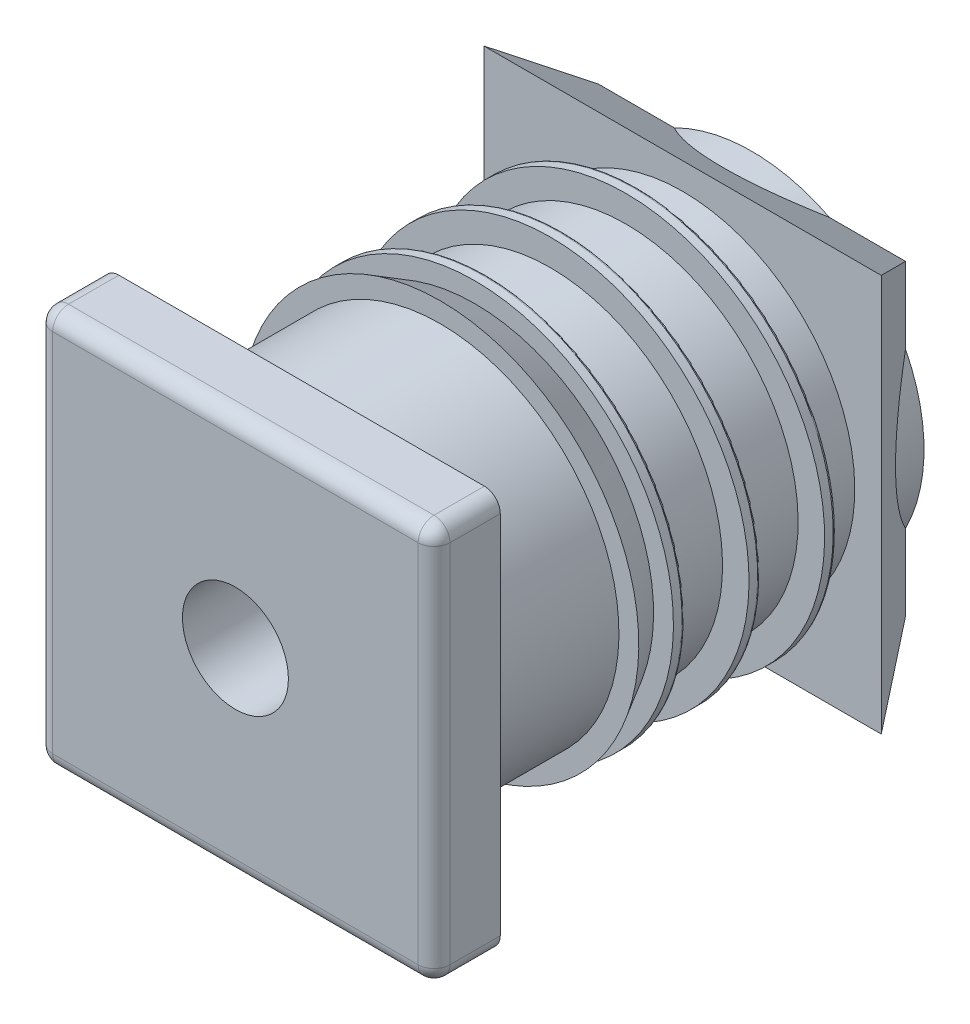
ISO-10303-21;
HEADER;
FILE_DESCRIPTION(('STEP AP214'),'2;1');
FILE_NAME('part.step','',(''),(''),'','','');
FILE_SCHEMA(('AUTOMOTIVE_DESIGN { 1 0 10303 214 1 1 1 1 }'));
ENDSEC;
DATA;
#1=APPLICATION_CONTEXT('core data for automotive mechanical design processes');
#2=APPLICATION_PROTOCOL_DEFINITION('international standard','automotive_design',2000,#1);
#3=PRODUCT_CONTEXT('',#1,'mechanical');
#4=PRODUCT('Part','Part','',(#3));
#5=PRODUCT_RELATED_PRODUCT_CATEGORY('part','',(#4));
#6=PRODUCT_DEFINITION_FORMATION('','',#4);
#7=PRODUCT_DEFINITION_CONTEXT('part definition',#1,'design');
#8=PRODUCT_DEFINITION('design','',#6,#7);
#9=PRODUCT_DEFINITION_SHAPE('','',#8);
#10=(LENGTH_UNIT() NAMED_UNIT(*) SI_UNIT(.MILLI.,.METRE.));
#11=(NAMED_UNIT(*) PLANE_ANGLE_UNIT() SI_UNIT($,.RADIAN.));
#12=(NAMED_UNIT(*) SI_UNIT($,.STERADIAN.) SOLID_ANGLE_UNIT());
#13=UNCERTAINTY_MEASURE_WITH_UNIT(LENGTH_MEASURE(1.E-05),#10,'distance_accuracy_value','');
#14=(GEOMETRIC_REPRESENTATION_CONTEXT(3) GLOBAL_UNCERTAINTY_ASSIGNED_CONTEXT((#13)) GLOBAL_UNIT_ASSIGNED_CONTEXT((#10,
#11,#12)) REPRESENTATION_CONTEXT('',''));
#15=CARTESIAN_POINT('',(0.,0.,0.));
#16=DIRECTION('',(0.,0.,1.));
#17=DIRECTION('',(1.,0.,0.));
#18=AXIS2_PLACEMENT_3D('',#15,#16,#17);
#19=CARTESIAN_POINT('',(-13.9,0.,-19.6340659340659));
#20=DIRECTION('',(0.,0.,-1.));
#21=DIRECTION('',(0.,-1.,0.));
#22=AXIS2_PLACEMENT_3D('',#19,#20,#21);
#23=PLANE('',#22);
#24=CARTESIAN_POINT('',(0.,0.,-19.6340659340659));
#25=DIRECTION('',(0.,0.,1.));
#26=DIRECTION('',(0.,-1.,0.));
#27=AXIS2_PLACEMENT_3D('',#24,#25,#26);
#28=CIRCLE('',#27,14.8);
#29=CARTESIAN_POINT('',(0.,-14.8,-19.6340659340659));
#30=VERTEX_POINT('',#29);
#31=CARTESIAN_POINT('',(0.,14.8,-19.6340659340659));
#32=VERTEX_POINT('',#31);
#33=EDGE_CURVE('E178',#30,#32,#28,.T.);
#34=ORIENTED_EDGE('',*,*,#33,.F.);
#35=CARTESIAN_POINT('',(0.,0.,-19.6340659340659));
#36=DIRECTION('',(0.,0.,1.));
#37=DIRECTION('',(-1.,0.,0.));
#38=AXIS2_PLACEMENT_3D('',#35,#36,#37);
#39=CIRCLE('',#38,14.8);
#40=CARTESIAN_POINT('',(-14.8,0.,-19.6340659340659));
#41=VERTEX_POINT('',#40);
#42=EDGE_CURVE('E171',#41,#30,#39,.T.);
#43=ORIENTED_EDGE('',*,*,#42,.F.);
#44=CARTESIAN_POINT('',(0.,0.,-19.6340659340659));
#45=DIRECTION('',(0.,0.,1.));
#46=DIRECTION('',(0.,1.,0.));
#47=AXIS2_PLACEMENT_3D('',#44,#45,#46);
#48=CIRCLE('',#47,14.8);
#49=EDGE_CURVE('E175',#32,#41,#48,.T.);
#50=ORIENTED_EDGE('',*,*,#49,.F.);
#51=EDGE_LOOP('',(#34,#43,#50));
#52=FACE_BOUND('',#51,.T.);
#53=CARTESIAN_POINT('',(0.,0.,-19.6340659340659));
#54=DIRECTION('',(0.,0.,1.));
#55=DIRECTION('',(0.,1.,0.));
#56=AXIS2_PLACEMENT_3D('',#53,#54,#55);
#57=CIRCLE('',#56,13.);
#58=CARTESIAN_POINT('',(0.,13.,-19.6340659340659));
#59=VERTEX_POINT('',#58);
#60=EDGE_CURVE('E188',#59,#59,#57,.F.);
#61=ORIENTED_EDGE('',*,*,#60,.F.);
#62=EDGE_LOOP('',(#61));
#63=FACE_BOUND('',#62,.T.);
#64=ADVANCED_FACE('F14',(#52,#63),#23,.T.);
#65=CARTESIAN_POINT('',(0.,0.,-22.0626373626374));
#66=DIRECTION('',(0.,0.,1.));
#67=DIRECTION('',(0.,1.,0.));
#68=AXIS2_PLACEMENT_3D('',#65,#66,#67);
#69=CYLINDRICAL_SURFACE('',#68,13.);
#70=CARTESIAN_POINT('',(0.,0.,-24.4912087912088));
#71=DIRECTION('',(0.,0.,1.));
#72=DIRECTION('',(0.,1.,0.));
#73=AXIS2_PLACEMENT_3D('',#70,#71,#72);
#74=CIRCLE('',#73,13.);
#75=CARTESIAN_POINT('',(0.,13.,-24.4912087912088));
#76=VERTEX_POINT('',#75);
#77=EDGE_CURVE('E339',#76,#76,#74,.F.);
#78=ORIENTED_EDGE('',*,*,#77,.F.);
#79=EDGE_LOOP('',(#78));
#80=FACE_BOUND('',#79,.T.);
#81=ORIENTED_EDGE('',*,*,#60,.T.);
#82=EDGE_LOOP('',(#81));
#83=FACE_BOUND('',#82,.T.);
#84=ADVANCED_FACE('F210',(#80,#83),#69,.T.);
#85=CARTESIAN_POINT('',(0.,0.,-19.4340659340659));
#86=DIRECTION('',(0.,0.,-1.));
#87=DIRECTION('',(0.,-1.,0.));
#88=AXIS2_PLACEMENT_3D('',#85,#86,#87);
#89=TOROIDAL_SURFACE('',#88,14.8,0.2);
#90=ORIENTED_EDGE('',*,*,#42,.T.);
#91=ORIENTED_EDGE('',*,*,#33,.T.);
#92=ORIENTED_EDGE('',*,*,#49,.T.);
#93=EDGE_LOOP('',(#90,#91,#92));
#94=FACE_BOUND('',#93,.T.);
#95=CARTESIAN_POINT('',(0.,0.,-19.4340659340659));
#96=DIRECTION('',(0.,0.,1.));
#97=DIRECTION('',(0.,1.,0.));
#98=AXIS2_PLACEMENT_3D('',#95,#96,#97);
#99=CIRCLE('',#98,15.);
#100=CARTESIAN_POINT('',(0.,15.,-19.4340659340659));
#101=VERTEX_POINT('',#100);
#102=EDGE_CURVE('E218',#101,#101,#99,.T.);
#103=ORIENTED_EDGE('',*,*,#102,.F.);
#104=EDGE_LOOP('',(#103));
#105=FACE_BOUND('',#104,.T.);
#106=ADVANCED_FACE('F185',(#94,#105),#89,.T.);
#107=CARTESIAN_POINT('',(-14.,0.,-24.4912087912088));
#108=DIRECTION('',(0.,0.,1.));
#109=DIRECTION('',(0.,1.,0.));
#110=AXIS2_PLACEMENT_3D('',#107,#108,#109);
#111=PLANE('',#110);
#112=ORIENTED_EDGE('',*,*,#77,.T.);
#113=EDGE_LOOP('',(#112));
#114=FACE_BOUND('',#113,.T.);
#115=CARTESIAN_POINT('',(0.,0.,-24.4912087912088));
#116=DIRECTION('',(0.,0.,1.));
#117=DIRECTION('',(0.,1.,0.));
#118=AXIS2_PLACEMENT_3D('',#115,#116,#117);
#119=CIRCLE('',#118,15.);
#120=CARTESIAN_POINT('',(0.,15.,-24.4912087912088));
#121=VERTEX_POINT('',#120);
#122=EDGE_CURVE('E336',#121,#121,#119,.F.);
#123=ORIENTED_EDGE('',*,*,#122,.F.);
#124=EDGE_LOOP('',(#123));
#125=FACE_BOUND('',#124,.T.);
#126=ADVANCED_FACE('F209',(#114,#125),#111,.T.);
#127=CARTESIAN_POINT('',(0.,0.,-19.1090659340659));
#128=DIRECTION('',(0.,0.,1.));
#129=DIRECTION('',(0.,1.,0.));
#130=AXIS2_PLACEMENT_3D('',#127,#128,#129);
#131=CYLINDRICAL_SURFACE('',#130,15.);
#132=ORIENTED_EDGE('',*,*,#102,.T.);
#133=EDGE_LOOP('',(#132));
#134=FACE_BOUND('',#133,.T.);
#135=CARTESIAN_POINT('',(0.,0.,-18.7840659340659));
#136=DIRECTION('',(0.,0.,1.));
#137=DIRECTION('',(0.,1.,0.));
#138=AXIS2_PLACEMENT_3D('',#135,#136,#137);
#139=CIRCLE('',#138,15.);
#140=CARTESIAN_POINT('',(0.,15.,-18.7840659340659));
#141=VERTEX_POINT('',#140);
#142=EDGE_CURVE('E333',#141,#141,#139,.T.);
#143=ORIENTED_EDGE('',*,*,#142,.F.);
#144=EDGE_LOOP('',(#143));
#145=FACE_BOUND('',#144,.T.);
#146=ADVANCED_FACE('F482',(#134,#145),#131,.T.);
#147=CARTESIAN_POINT('',(0.,0.,-24.8162087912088));
#148=DIRECTION('',(0.,0.,1.));
#149=DIRECTION('',(0.,1.,0.));
#150=AXIS2_PLACEMENT_3D('',#147,#148,#149);
#151=CYLINDRICAL_SURFACE('',#150,15.);
#152=ORIENTED_EDGE('',*,*,#122,.T.);
#153=EDGE_LOOP('',(#152));
#154=FACE_BOUND('',#153,.T.);
#155=CARTESIAN_POINT('',(0.,0.,-25.1412087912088));
#156=DIRECTION('',(0.,0.,-1.));
#157=DIRECTION('',(0.,-1.,0.));
#158=AXIS2_PLACEMENT_3D('',#155,#156,#157);
#159=CIRCLE('',#158,15.);
#160=CARTESIAN_POINT('',(0.,-15.,-25.1412087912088));
#161=VERTEX_POINT('',#160);
#162=EDGE_CURVE('E332',#161,#161,#159,.T.);
#163=ORIENTED_EDGE('',*,*,#162,.F.);
#164=EDGE_LOOP('',(#163));
#165=FACE_BOUND('',#164,.T.);
#166=ADVANCED_FACE('F480',(#154,#165),#151,.T.);
#167=CARTESIAN_POINT('',(-14.,0.,-18.7840659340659));
#168=DIRECTION('',(0.,0.,1.));
#169=DIRECTION('',(0.,1.,0.));
#170=AXIS2_PLACEMENT_3D('',#167,#168,#169);
#171=PLANE('',#170);
#172=CARTESIAN_POINT('',(0.,0.,-18.7840659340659));
#173=DIRECTION('',(0.,0.,1.));
#174=DIRECTION('',(0.,1.,0.));
#175=AXIS2_PLACEMENT_3D('',#172,#173,#174);
#176=CIRCLE('',#175,13.);
#177=CARTESIAN_POINT('',(0.,13.,-18.7840659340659));
#178=VERTEX_POINT('',#177);
#179=EDGE_CURVE('E328',#178,#178,#176,.T.);
#180=ORIENTED_EDGE('',*,*,#179,.F.);
#181=EDGE_LOOP('',(#180));
#182=FACE_BOUND('',#181,.T.);
#183=ORIENTED_EDGE('',*,*,#142,.T.);
#184=EDGE_LOOP('',(#183));
#185=FACE_BOUND('',#184,.T.);
#186=ADVANCED_FACE('F460',(#182,#185),#171,.T.);
#187=CARTESIAN_POINT('',(0.,0.,-25.1412087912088));
#188=DIRECTION('',(0.,0.,-1.));
#189=DIRECTION('',(0.,-1.,0.));
#190=AXIS2_PLACEMENT_3D('',#187,#188,#189);
#191=TOROIDAL_SURFACE('',#190,14.8,0.2);
#192=ORIENTED_EDGE('',*,*,#162,.T.);
#193=EDGE_LOOP('',(#192));
#194=FACE_BOUND('',#193,.T.);
#195=CARTESIAN_POINT('',(0.,0.,-25.3412087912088));
#196=DIRECTION('',(0.,0.,1.));
#197=DIRECTION('',(0.,1.,0.));
#198=AXIS2_PLACEMENT_3D('',#195,#196,#197);
#199=CIRCLE('',#198,14.8);
#200=CARTESIAN_POINT('',(-14.8,0.,-25.3412087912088));
#201=VERTEX_POINT('',#200);
#202=CARTESIAN_POINT('',(0.,14.8,-25.3412087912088));
#203=VERTEX_POINT('',#202);
#204=EDGE_CURVE('E331',#201,#203,#199,.F.);
#205=ORIENTED_EDGE('',*,*,#204,.F.);
#206=CARTESIAN_POINT('',(0.,0.,-25.3412087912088));
#207=DIRECTION('',(0.,0.,1.));
#208=DIRECTION('',(-1.,0.,0.));
#209=AXIS2_PLACEMENT_3D('',#206,#207,#208);
#210=CIRCLE('',#209,14.8);
#211=CARTESIAN_POINT('',(0.,-14.8,-25.3412087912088));
#212=VERTEX_POINT('',#211);
#213=EDGE_CURVE('E327',#212,#201,#210,.F.);
#214=ORIENTED_EDGE('',*,*,#213,.F.);
#215=CARTESIAN_POINT('',(0.,0.,-25.3412087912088));
#216=DIRECTION('',(0.,0.,1.));
#217=DIRECTION('',(0.,-1.,0.));
#218=AXIS2_PLACEMENT_3D('',#215,#216,#217);
#219=CIRCLE('',#218,14.8);
#220=EDGE_CURVE('E434',#203,#212,#219,.F.);
#221=ORIENTED_EDGE('',*,*,#220,.F.);
#222=EDGE_LOOP('',(#205,#214,#221));
#223=FACE_BOUND('',#222,.T.);
#224=ADVANCED_FACE('F455',(#194,#223),#191,.T.);
#225=CARTESIAN_POINT('',(0.,0.,-16.3554945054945));
#226=DIRECTION('',(0.,0.,1.));
#227=DIRECTION('',(0.,1.,0.));
#228=AXIS2_PLACEMENT_3D('',#225,#226,#227);
#229=CYLINDRICAL_SURFACE('',#228,13.);
#230=ORIENTED_EDGE('',*,*,#179,.T.);
#231=EDGE_LOOP('',(#230));
#232=FACE_BOUND('',#231,.T.);
#233=CARTESIAN_POINT('',(0.,0.,-13.9269230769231));
#234=DIRECTION('',(0.,0.,1.));
#235=DIRECTION('',(0.,1.,0.));
#236=AXIS2_PLACEMENT_3D('',#233,#234,#235);
#237=CIRCLE('',#236,13.);
#238=CARTESIAN_POINT('',(0.,13.,-13.9269230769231));
#239=VERTEX_POINT('',#238);
#240=EDGE_CURVE('E324',#239,#239,#237,.T.);
#241=ORIENTED_EDGE('',*,*,#240,.F.);
#242=EDGE_LOOP('',(#241));
#243=FACE_BOUND('',#242,.T.);
#244=ADVANCED_FACE('F459',(#232,#243),#229,.T.);
#245=CARTESIAN_POINT('',(-13.9,0.,-25.3412087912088));
#246=DIRECTION('',(0.,0.,-1.));
#247=DIRECTION('',(0.,-1.,0.));
#248=AXIS2_PLACEMENT_3D('',#245,#246,#247);
#249=PLANE('',#248);
#250=ORIENTED_EDGE('',*,*,#220,.T.);
#251=ORIENTED_EDGE('',*,*,#213,.T.);
#252=ORIENTED_EDGE('',*,*,#204,.T.);
#253=EDGE_LOOP('',(#250,#251,#252));
#254=FACE_BOUND('',#253,.T.);
#255=CARTESIAN_POINT('',(0.,0.,-25.3412087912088));
#256=DIRECTION('',(0.,0.,1.));
#257=DIRECTION('',(0.,1.,0.));
#258=AXIS2_PLACEMENT_3D('',#255,#256,#257);
#259=CIRCLE('',#258,13.);
#260=CARTESIAN_POINT('',(0.,13.,-25.3412087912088));
#261=VERTEX_POINT('',#260);
#262=EDGE_CURVE('E320',#261,#261,#259,.F.);
#263=ORIENTED_EDGE('',*,*,#262,.F.);
#264=EDGE_LOOP('',(#263));
#265=FACE_BOUND('',#264,.T.);
#266=ADVANCED_FACE('F392',(#254,#265),#249,.T.);
#267=CARTESIAN_POINT('',(-13.9,0.,-13.9269230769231));
#268=DIRECTION('',(0.,0.,-1.));
#269=DIRECTION('',(0.,-1.,0.));
#270=AXIS2_PLACEMENT_3D('',#267,#268,#269);
#271=PLANE('',#270);
#272=CARTESIAN_POINT('',(0.,0.,-13.9269230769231));
#273=DIRECTION('',(0.,0.,1.));
#274=DIRECTION('',(0.,-1.,0.));
#275=AXIS2_PLACEMENT_3D('',#272,#273,#274);
#276=CIRCLE('',#275,14.8);
#277=CARTESIAN_POINT('',(0.,-14.8,-13.9269230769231));
#278=VERTEX_POINT('',#277);
#279=CARTESIAN_POINT('',(0.,14.8,-13.9269230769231));
#280=VERTEX_POINT('',#279);
#281=EDGE_CURVE('E319',#278,#280,#276,.T.);
#282=ORIENTED_EDGE('',*,*,#281,.F.);
#283=CARTESIAN_POINT('',(0.,0.,-13.9269230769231));
#284=DIRECTION('',(0.,0.,1.));
#285=DIRECTION('',(-1.,0.,0.));
#286=AXIS2_PLACEMENT_3D('',#283,#284,#285);
#287=CIRCLE('',#286,14.8);
#288=CARTESIAN_POINT('',(-14.8,0.,-13.9269230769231));
#289=VERTEX_POINT('',#288);
#290=EDGE_CURVE('E409',#289,#278,#287,.T.);
#291=ORIENTED_EDGE('',*,*,#290,.F.);
#292=CARTESIAN_POINT('',(0.,0.,-13.9269230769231));
#293=DIRECTION('',(0.,0.,1.));
#294=DIRECTION('',(0.,1.,0.));
#295=AXIS2_PLACEMENT_3D('',#292,#293,#294);
#296=CIRCLE('',#295,14.8);
#297=EDGE_CURVE('E323',#280,#289,#296,.T.);
#298=ORIENTED_EDGE('',*,*,#297,.F.);
#299=EDGE_LOOP('',(#282,#291,#298));
#300=FACE_BOUND('',#299,.T.);
#301=ORIENTED_EDGE('',*,*,#240,.T.);
#302=EDGE_LOOP('',(#301));
#303=FACE_BOUND('',#302,.T.);
#304=ADVANCED_FACE('F383',(#300,#303),#271,.T.);
#305=CARTESIAN_POINT('',(0.,0.,-29.6706043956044));
#306=DIRECTION('',(0.,0.,1.));
#307=DIRECTION('',(0.,1.,0.));
#308=AXIS2_PLACEMENT_3D('',#305,#306,#307);
#309=CYLINDRICAL_SURFACE('',#308,13.);
#310=ORIENTED_EDGE('',*,*,#262,.T.);
#311=EDGE_LOOP('',(#310));
#312=FACE_BOUND('',#311,.T.);
#313=CARTESIAN_POINT('',(0.,0.,-28.7692307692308));
#314=DIRECTION('',(0.,0.,1.));
#315=DIRECTION('',(0.,1.,0.));
#316=AXIS2_PLACEMENT_3D('',#313,#314,#315);
#317=CIRCLE('',#316,13.);
#318=CARTESIAN_POINT('',(0.,13.,-28.7692307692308));
#319=VERTEX_POINT('',#318);
#320=EDGE_CURVE('E315',#319,#319,#317,.F.);
#321=ORIENTED_EDGE('',*,*,#320,.F.);
#322=EDGE_LOOP('',(#321));
#323=FACE_BOUND('',#322,.T.);
#324=ADVANCED_FACE('F366',(#312,#323),#309,.T.);
#325=CARTESIAN_POINT('',(0.,0.,-13.7269230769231));
#326=DIRECTION('',(0.,0.,-1.));
#327=DIRECTION('',(0.,-1.,0.));
#328=AXIS2_PLACEMENT_3D('',#325,#326,#327);
#329=TOROIDAL_SURFACE('',#328,14.8,0.2);
#330=ORIENTED_EDGE('',*,*,#290,.T.);
#331=ORIENTED_EDGE('',*,*,#281,.T.);
#332=ORIENTED_EDGE('',*,*,#297,.T.);
#333=EDGE_LOOP('',(#330,#331,#332));
#334=FACE_BOUND('',#333,.T.);
#335=CARTESIAN_POINT('',(0.,0.,-13.7269230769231));
#336=DIRECTION('',(0.,0.,1.));
#337=DIRECTION('',(0.,1.,0.));
#338=AXIS2_PLACEMENT_3D('',#335,#336,#337);
#339=CIRCLE('',#338,15.);
#340=CARTESIAN_POINT('',(0.,15.,-13.7269230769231));
#341=VERTEX_POINT('',#340);
#342=EDGE_CURVE('E318',#341,#341,#339,.T.);
#343=ORIENTED_EDGE('',*,*,#342,.F.);
#344=EDGE_LOOP('',(#343));
#345=FACE_BOUND('',#344,.T.);
#346=ADVANCED_FACE('F354',(#334,#345),#329,.T.);
#347=CARTESIAN_POINT('',(15.,-15.,-28.7692307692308));
#348=DIRECTION('',(0.,0.,1.));
#349=DIRECTION('',(0.,1.,0.));
#350=AXIS2_PLACEMENT_3D('',#347,#348,#349);
#351=PLANE('',#350);
#352=DIRECTION('',(-1.,0.,0.));
#353=VECTOR('',#352,1.);
#354=CARTESIAN_POINT('',(-15.,-15.,-28.7692307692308));
#355=LINE('',#354,#353);
#356=CARTESIAN_POINT('',(-15.,-15.,-28.7692307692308));
#357=VERTEX_POINT('',#356);
#358=CARTESIAN_POINT('',(15.,-15.,-28.7692307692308));
#359=VERTEX_POINT('',#358);
#360=EDGE_CURVE('E314',#357,#359,#355,.F.);
#361=ORIENTED_EDGE('',*,*,#360,.T.);
#362=DIRECTION('',(0.,-1.,0.));
#363=VECTOR('',#362,1.);
#364=CARTESIAN_POINT('',(15.,-15.,-28.7692307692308));
#365=LINE('',#364,#363);
#366=CARTESIAN_POINT('',(15.,15.,-28.7692307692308));
#367=VERTEX_POINT('',#366);
#368=EDGE_CURVE('E621',#367,#359,#365,.T.);
#369=ORIENTED_EDGE('',*,*,#368,.F.);
#370=DIRECTION('',(-1.,0.,0.));
#371=VECTOR('',#370,1.);
#372=CARTESIAN_POINT('',(-15.,15.,-28.7692307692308));
#373=LINE('',#372,#371);
#374=CARTESIAN_POINT('',(-15.,15.,-28.7692307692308));
#375=VERTEX_POINT('',#374);
#376=EDGE_CURVE('E623',#367,#375,#373,.T.);
#377=ORIENTED_EDGE('',*,*,#376,.T.);
#378=DIRECTION('',(0.,-1.,0.));
#379=VECTOR('',#378,1.);
#380=CARTESIAN_POINT('',(-15.,-15.,-28.7692307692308));
#381=LINE('',#380,#379);
#382=EDGE_CURVE('E624',#357,#375,#381,.F.);
#383=ORIENTED_EDGE('',*,*,#382,.F.);
#384=EDGE_LOOP('',(#361,#369,#377,#383));
#385=FACE_BOUND('',#384,.T.);
#386=ORIENTED_EDGE('',*,*,#320,.T.);
#387=EDGE_LOOP('',(#386));
#388=FACE_BOUND('',#387,.T.);
#389=ADVANCED_FACE('F365',(#385,#388),#351,.T.);
#390=CARTESIAN_POINT('',(0.,0.,-13.4019230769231));
#391=DIRECTION('',(0.,0.,1.));
#392=DIRECTION('',(0.,1.,0.));
#393=AXIS2_PLACEMENT_3D('',#390,#391,#392);
#394=CYLINDRICAL_SURFACE('',#393,15.);
#395=ORIENTED_EDGE('',*,*,#342,.T.);
#396=EDGE_LOOP('',(#395));
#397=FACE_BOUND('',#396,.T.);
#398=CARTESIAN_POINT('',(0.,0.,-13.0769230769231));
#399=DIRECTION('',(0.,0.,1.));
#400=DIRECTION('',(0.,1.,0.));
#401=AXIS2_PLACEMENT_3D('',#398,#399,#400);
#402=CIRCLE('',#401,15.);
#403=CARTESIAN_POINT('',(0.,15.,-13.0769230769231));
#404=VERTEX_POINT('',#403);
#405=EDGE_CURVE('E298',#404,#404,#402,.T.);
#406=ORIENTED_EDGE('',*,*,#405,.F.);
#407=EDGE_LOOP('',(#406));
#408=FACE_BOUND('',#407,.T.);
#409=ADVANCED_FACE('F602',(#397,#408),#394,.T.);
#410=CARTESIAN_POINT('',(0.,0.,-29.6706043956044));
#411=DIRECTION('',(0.,0.,1.));
#412=DIRECTION('',(0.,1.,0.));
#413=AXIS2_PLACEMENT_3D('',#410,#411,#412);
#414=CYLINDRICAL_SURFACE('',#413,13.);
#415=CARTESIAN_POINT('',(0.,0.,-51.8672052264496));
#416=DIRECTION('',(0.,0.838670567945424,0.544639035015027));
#417=DIRECTION('',(0.,-0.544639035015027,0.838670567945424));
#418=AXIS2_PLACEMENT_3D('',#415,#416,#417);
#419=ELLIPSE('',#418,23.8690199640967,13.);
#420=CARTESIAN_POINT('',(5.86243119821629,-11.6030987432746,-34.));
#421=VERTEX_POINT('',#420);
#422=CARTESIAN_POINT('',(-5.86243119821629,-11.6030987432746,-34.));
#423=VERTEX_POINT('',#422);
#424=EDGE_CURVE('E120',#421,#423,#419,.F.);
#425=ORIENTED_EDGE('',*,*,#424,.T.);
#426=CARTESIAN_POINT('',(0.,0.,-34.));
#427=DIRECTION('',(0.,0.,1.));
#428=DIRECTION('',(0.,1.,0.));
#429=AXIS2_PLACEMENT_3D('',#426,#427,#428);
#430=CIRCLE('',#429,13.);
#431=EDGE_CURVE('E293',#421,#423,#430,.F.);
#432=ORIENTED_EDGE('',*,*,#431,.F.);
#433=EDGE_LOOP('',(#425,#432));
#434=FACE_BOUND('',#433,.T.);
#435=ADVANCED_FACE('F600',(#434),#414,.T.);
#436=CARTESIAN_POINT('',(-15.,-15.,-28.7692307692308));
#437=DIRECTION('',(0.,0.838670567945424,0.544639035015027));
#438=DIRECTION('',(0.,0.544639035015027,-0.838670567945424));
#439=AXIS2_PLACEMENT_3D('',#436,#437,#438);
#440=PLANE('',#439);
#441=DIRECTION('',(-1.,0.,0.));
#442=VECTOR('',#441,1.);
#443=CARTESIAN_POINT('',(-11.6030987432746,-11.6030987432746,-34.));
#444=LINE('',#443,#442);
#445=CARTESIAN_POINT('',(11.6030987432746,-11.6030987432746,-34.));
#446=VERTEX_POINT('',#445);
#447=EDGE_CURVE('E297',#446,#421,#444,.T.);
#448=ORIENTED_EDGE('',*,*,#447,.F.);
#449=DIRECTION('',(-0.47830007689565,0.478300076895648,-0.736517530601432));
#450=VECTOR('',#449,1.);
#451=CARTESIAN_POINT('',(15.,-15.,-28.7692307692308));
#452=LINE('',#451,#450);
#453=EDGE_CURVE('E127',#359,#446,#452,.T.);
#454=ORIENTED_EDGE('',*,*,#453,.F.);
#455=ORIENTED_EDGE('',*,*,#360,.F.);
#456=DIRECTION('',(-0.47830007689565,-0.478300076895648,0.736517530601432));
#457=VECTOR('',#456,1.);
#458=CARTESIAN_POINT('',(-11.6030987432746,-11.6030987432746,-34.));
#459=LINE('',#458,#457);
#460=CARTESIAN_POINT('',(-11.6030987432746,-11.6030987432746,-34.));
#461=VERTEX_POINT('',#460);
#462=EDGE_CURVE('E312',#461,#357,#459,.T.);
#463=ORIENTED_EDGE('',*,*,#462,.F.);
#464=DIRECTION('',(-1.,0.,0.));
#465=VECTOR('',#464,1.);
#466=CARTESIAN_POINT('',(-11.6030987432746,-11.6030987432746,-34.));
#467=LINE('',#466,#465);
#468=EDGE_CURVE('E296',#423,#461,#467,.T.);
#469=ORIENTED_EDGE('',*,*,#468,.F.);
#470=ORIENTED_EDGE('',*,*,#424,.F.);
#471=EDGE_LOOP('',(#448,#454,#455,#463,#469,#470));
#472=FACE_BOUND('',#471,.T.);
#473=ADVANCED_FACE('F596',(#472),#440,.F.);
#474=CARTESIAN_POINT('',(0.,0.,-29.6706043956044));
#475=DIRECTION('',(0.,0.,1.));
#476=DIRECTION('',(0.,1.,0.));
#477=AXIS2_PLACEMENT_3D('',#474,#475,#476);
#478=CYLINDRICAL_SURFACE('',#477,13.);
#479=CARTESIAN_POINT('',(0.,0.,-51.8672052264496));
#480=DIRECTION('',(-0.838670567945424,0.,-0.544639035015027));
#481=DIRECTION('',(-0.544639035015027,0.,0.838670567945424));
#482=AXIS2_PLACEMENT_3D('',#479,#480,#481);
#483=ELLIPSE('',#482,23.8690199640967,13.);
#484=CARTESIAN_POINT('',(-11.6030987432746,5.8624311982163,-34.));
#485=VERTEX_POINT('',#484);
#486=CARTESIAN_POINT('',(-11.6030987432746,-5.86243119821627,-34.));
#487=VERTEX_POINT('',#486);
#488=EDGE_CURVE('E309',#485,#487,#483,.F.);
#489=ORIENTED_EDGE('',*,*,#488,.F.);
#490=CARTESIAN_POINT('',(0.,0.,-34.));
#491=DIRECTION('',(0.,0.,1.));
#492=DIRECTION('',(0.,1.,0.));
#493=AXIS2_PLACEMENT_3D('',#490,#491,#492);
#494=CIRCLE('',#493,13.);
#495=EDGE_CURVE('E288',#487,#485,#494,.F.);
#496=ORIENTED_EDGE('',*,*,#495,.F.);
#497=EDGE_LOOP('',(#489,#496));
#498=FACE_BOUND('',#497,.T.);
#499=ADVANCED_FACE('F592',(#498),#478,.T.);
#500=CARTESIAN_POINT('',(-15.,-15.,-28.7692307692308));
#501=DIRECTION('',(-0.838670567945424,0.,-0.544639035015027));
#502=DIRECTION('',(0.544639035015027,0.,-0.838670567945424));
#503=AXIS2_PLACEMENT_3D('',#500,#501,#502);
#504=PLANE('',#503);
#505=DIRECTION('',(0.478300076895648,-0.47830007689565,-0.736517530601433));
#506=VECTOR('',#505,1.);
#507=CARTESIAN_POINT('',(-15.,15.,-28.7692307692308));
#508=LINE('',#507,#506);
#509=CARTESIAN_POINT('',(-11.6030987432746,11.6030987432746,-34.));
#510=VERTEX_POINT('',#509);
#511=EDGE_CURVE('E308',#375,#510,#508,.T.);
#512=ORIENTED_EDGE('',*,*,#511,.T.);
#513=DIRECTION('',(0.,-1.,0.));
#514=VECTOR('',#513,1.);
#515=CARTESIAN_POINT('',(-11.6030987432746,-15.,-34.));
#516=LINE('',#515,#514);
#517=EDGE_CURVE('E291',#485,#510,#516,.F.);
#518=ORIENTED_EDGE('',*,*,#517,.F.);
#519=ORIENTED_EDGE('',*,*,#488,.T.);
#520=DIRECTION('',(0.,-1.,0.));
#521=VECTOR('',#520,1.);
#522=CARTESIAN_POINT('',(-11.6030987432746,-15.,-34.));
#523=LINE('',#522,#521);
#524=EDGE_CURVE('E292',#461,#487,#523,.F.);
#525=ORIENTED_EDGE('',*,*,#524,.F.);
#526=ORIENTED_EDGE('',*,*,#462,.T.);
#527=ORIENTED_EDGE('',*,*,#382,.T.);
#528=EDGE_LOOP('',(#512,#518,#519,#525,#526,#527));
#529=FACE_BOUND('',#528,.T.);
#530=ADVANCED_FACE('F588',(#529),#504,.T.);
#531=CARTESIAN_POINT('',(0.,0.,-29.6706043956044));
#532=DIRECTION('',(0.,0.,1.));
#533=DIRECTION('',(0.,1.,0.));
#534=AXIS2_PLACEMENT_3D('',#531,#532,#533);
#535=CYLINDRICAL_SURFACE('',#534,13.);
#536=CARTESIAN_POINT('',(0.,0.,-51.8672052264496));
#537=DIRECTION('',(0.,-0.838670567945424,0.544639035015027));
#538=DIRECTION('',(0.,0.544639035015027,0.838670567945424));
#539=AXIS2_PLACEMENT_3D('',#536,#537,#538);
#540=ELLIPSE('',#539,23.8690199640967,13.);
#541=CARTESIAN_POINT('',(-5.86243119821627,11.6030987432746,-34.));
#542=VERTEX_POINT('',#541);
#543=CARTESIAN_POINT('',(5.86243119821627,11.6030987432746,-34.));
#544=VERTEX_POINT('',#543);
#545=EDGE_CURVE('E305',#542,#544,#540,.F.);
#546=ORIENTED_EDGE('',*,*,#545,.T.);
#547=CARTESIAN_POINT('',(0.,0.,-34.));
#548=DIRECTION('',(0.,0.,1.));
#549=DIRECTION('',(0.,1.,0.));
#550=AXIS2_PLACEMENT_3D('',#547,#548,#549);
#551=CIRCLE('',#550,13.);
#552=EDGE_CURVE('E283',#542,#544,#551,.F.);
#553=ORIENTED_EDGE('',*,*,#552,.F.);
#554=EDGE_LOOP('',(#546,#553));
#555=FACE_BOUND('',#554,.T.);
#556=ADVANCED_FACE('F584',(#555),#535,.T.);
#557=CARTESIAN_POINT('',(-15.,11.6030987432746,-34.));
#558=DIRECTION('',(0.,-0.838670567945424,0.544639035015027));
#559=DIRECTION('',(0.,0.544639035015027,0.838670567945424));
#560=AXIS2_PLACEMENT_3D('',#557,#558,#559);
#561=PLANE('',#560);
#562=DIRECTION('',(-1.,0.,0.));
#563=VECTOR('',#562,1.);
#564=CARTESIAN_POINT('',(-11.6030987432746,11.6030987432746,-34.));
#565=LINE('',#564,#563);
#566=EDGE_CURVE('E287',#510,#542,#565,.F.);
#567=ORIENTED_EDGE('',*,*,#566,.F.);
#568=ORIENTED_EDGE('',*,*,#511,.F.);
#569=ORIENTED_EDGE('',*,*,#376,.F.);
#570=DIRECTION('',(0.47830007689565,0.478300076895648,0.736517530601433));
#571=VECTOR('',#570,1.);
#572=CARTESIAN_POINT('',(11.6030987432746,11.6030987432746,-34.));
#573=LINE('',#572,#571);
#574=CARTESIAN_POINT('',(11.6030987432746,11.6030987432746,-34.));
#575=VERTEX_POINT('',#574);
#576=EDGE_CURVE('E307',#575,#367,#573,.T.);
#577=ORIENTED_EDGE('',*,*,#576,.F.);
#578=DIRECTION('',(-1.,0.,0.));
#579=VECTOR('',#578,1.);
#580=CARTESIAN_POINT('',(-11.6030987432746,11.6030987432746,-34.));
#581=LINE('',#580,#579);
#582=EDGE_CURVE('E286',#544,#575,#581,.F.);
#583=ORIENTED_EDGE('',*,*,#582,.F.);
#584=ORIENTED_EDGE('',*,*,#545,.F.);
#585=EDGE_LOOP('',(#567,#568,#569,#577,#583,#584));
#586=FACE_BOUND('',#585,.T.);
#587=ADVANCED_FACE('F581',(#586),#561,.F.);
#588=CARTESIAN_POINT('',(11.6030987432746,-15.,-34.));
#589=DIRECTION('',(0.838670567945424,0.,-0.544639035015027));
#590=DIRECTION('',(0.544639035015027,0.,0.838670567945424));
#591=AXIS2_PLACEMENT_3D('',#588,#589,#590);
#592=PLANE('',#591);
#593=ORIENTED_EDGE('',*,*,#453,.T.);
#594=DIRECTION('',(0.,-1.,0.));
#595=VECTOR('',#594,1.);
#596=CARTESIAN_POINT('',(11.6030987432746,-15.,-34.));
#597=LINE('',#596,#595);
#598=CARTESIAN_POINT('',(11.6030987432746,-5.86243119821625,-34.));
#599=VERTEX_POINT('',#598);
#600=EDGE_CURVE('E301',#599,#446,#597,.T.);
#601=ORIENTED_EDGE('',*,*,#600,.F.);
#602=CARTESIAN_POINT('',(0.,0.,-51.8672052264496));
#603=DIRECTION('',(0.838670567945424,0.,-0.544639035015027));
#604=DIRECTION('',(0.544639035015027,0.,0.838670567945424));
#605=AXIS2_PLACEMENT_3D('',#602,#603,#604);
#606=ELLIPSE('',#605,23.8690199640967,13.);
#607=CARTESIAN_POINT('',(11.6030987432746,5.86243119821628,-34.));
#608=VERTEX_POINT('',#607);
#609=EDGE_CURVE('E302',#608,#599,#606,.T.);
#610=ORIENTED_EDGE('',*,*,#609,.F.);
#611=DIRECTION('',(0.,-1.,0.));
#612=VECTOR('',#611,1.);
#613=CARTESIAN_POINT('',(11.6030987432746,-15.,-34.));
#614=LINE('',#613,#612);
#615=EDGE_CURVE('E282',#575,#608,#614,.T.);
#616=ORIENTED_EDGE('',*,*,#615,.F.);
#617=ORIENTED_EDGE('',*,*,#576,.T.);
#618=ORIENTED_EDGE('',*,*,#368,.T.);
#619=EDGE_LOOP('',(#593,#601,#610,#616,#617,#618));
#620=FACE_BOUND('',#619,.T.);
#621=ADVANCED_FACE('F577',(#620),#592,.T.);
#622=CARTESIAN_POINT('',(0.,0.,-29.6706043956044));
#623=DIRECTION('',(0.,0.,1.));
#624=DIRECTION('',(0.,1.,0.));
#625=AXIS2_PLACEMENT_3D('',#622,#623,#624);
#626=CYLINDRICAL_SURFACE('',#625,13.);
#627=ORIENTED_EDGE('',*,*,#609,.T.);
#628=CARTESIAN_POINT('',(0.,0.,-34.));
#629=DIRECTION('',(0.,0.,1.));
#630=DIRECTION('',(0.,1.,0.));
#631=AXIS2_PLACEMENT_3D('',#628,#629,#630);
#632=CIRCLE('',#631,13.);
#633=EDGE_CURVE('E279',#608,#599,#632,.F.);
#634=ORIENTED_EDGE('',*,*,#633,.F.);
#635=EDGE_LOOP('',(#627,#634));
#636=FACE_BOUND('',#635,.T.);
#637=ADVANCED_FACE('F573',(#636),#626,.T.);
#638=CARTESIAN_POINT('',(-14.25,0.,-13.0769230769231));
#639=DIRECTION('',(0.,0.,1.));
#640=DIRECTION('',(0.,1.,0.));
#641=AXIS2_PLACEMENT_3D('',#638,#639,#640);
#642=PLANE('',#641);
#643=CARTESIAN_POINT('',(0.,0.,-13.0769230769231));
#644=DIRECTION('',(0.,0.,1.));
#645=DIRECTION('',(0.,1.,0.));
#646=AXIS2_PLACEMENT_3D('',#643,#644,#645);
#647=CIRCLE('',#646,13.5);
#648=CARTESIAN_POINT('',(0.,13.5,-13.0769230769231));
#649=VERTEX_POINT('',#648);
#650=EDGE_CURVE('E276',#649,#649,#647,.T.);
#651=ORIENTED_EDGE('',*,*,#650,.F.);
#652=EDGE_LOOP('',(#651));
#653=FACE_BOUND('',#652,.T.);
#654=ORIENTED_EDGE('',*,*,#405,.T.);
#655=EDGE_LOOP('',(#654));
#656=FACE_BOUND('',#655,.T.);
#657=ADVANCED_FACE('F569',(#653,#656),#642,.T.);
#658=CARTESIAN_POINT('',(-11.6030987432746,-15.,-34.));
#659=DIRECTION('',(0.,0.,-1.));
#660=DIRECTION('',(0.,-1.,0.));
#661=AXIS2_PLACEMENT_3D('',#658,#659,#660);
#662=PLANE('',#661);
#663=ORIENTED_EDGE('',*,*,#615,.T.);
#664=ORIENTED_EDGE('',*,*,#633,.T.);
#665=ORIENTED_EDGE('',*,*,#600,.T.);
#666=ORIENTED_EDGE('',*,*,#447,.T.);
#667=ORIENTED_EDGE('',*,*,#431,.T.);
#668=ORIENTED_EDGE('',*,*,#468,.T.);
#669=ORIENTED_EDGE('',*,*,#524,.T.);
#670=ORIENTED_EDGE('',*,*,#495,.T.);
#671=ORIENTED_EDGE('',*,*,#517,.T.);
#672=ORIENTED_EDGE('',*,*,#566,.T.);
#673=ORIENTED_EDGE('',*,*,#552,.T.);
#674=ORIENTED_EDGE('',*,*,#582,.T.);
#675=EDGE_LOOP('',(#663,#664,#665,#666,#667,#668,#669,#670,#671,#672,#673,#674));
#676=FACE_BOUND('',#675,.T.);
#677=CARTESIAN_POINT('',(0.,0.,-34.));
#678=DIRECTION('',(0.,0.,-1.));
#679=DIRECTION('',(0.,-1.,0.));
#680=AXIS2_PLACEMENT_3D('',#677,#678,#679);
#681=CIRCLE('',#680,4.);
#682=CARTESIAN_POINT('',(0.,-3.99999999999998,-34.));
#683=VERTEX_POINT('',#682);
#684=EDGE_CURVE('E709',#683,#683,#681,.T.);
#685=ORIENTED_EDGE('',*,*,#684,.F.);
#686=EDGE_LOOP('',(#685));
#687=FACE_BOUND('',#686,.T.);
#688=ADVANCED_FACE('F565',(#676,#687),#662,.T.);
#689=CARTESIAN_POINT('',(0.,0.,-10.4615384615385));
#690=DIRECTION('',(0.,0.,1.));
#691=DIRECTION('',(0.,1.,0.));
#692=AXIS2_PLACEMENT_3D('',#689,#690,#691);
#693=CONICAL_SURFACE('',#692,15.,0.520728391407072);
#694=ORIENTED_EDGE('',*,*,#650,.T.);
#695=EDGE_LOOP('',(#694));
#696=FACE_BOUND('',#695,.T.);
#697=CARTESIAN_POINT('',(0.,0.,-10.4615384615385));
#698=DIRECTION('',(0.,0.,1.));
#699=DIRECTION('',(0.,1.,0.));
#700=AXIS2_PLACEMENT_3D('',#697,#698,#699);
#701=CIRCLE('',#700,15.);
#702=CARTESIAN_POINT('',(0.,15.,-10.4615384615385));
#703=VERTEX_POINT('',#702);
#704=EDGE_CURVE('E273',#703,#703,#701,.T.);
#705=ORIENTED_EDGE('',*,*,#704,.F.);
#706=EDGE_LOOP('',(#705));
#707=FACE_BOUND('',#706,.T.);
#708=ADVANCED_FACE('F561',(#696,#707),#693,.T.);
#709=CARTESIAN_POINT('',(-14.25,0.,-10.4615384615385));
#710=DIRECTION('',(0.,0.,1.));
#711=DIRECTION('',(0.,1.,0.));
#712=AXIS2_PLACEMENT_3D('',#709,#710,#711);
#713=PLANE('',#712);
#714=CARTESIAN_POINT('',(0.,0.,-10.4615384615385));
#715=DIRECTION('',(0.,0.,1.));
#716=DIRECTION('',(0.,1.,0.));
#717=AXIS2_PLACEMENT_3D('',#714,#715,#716);
#718=CIRCLE('',#717,13.5);
#719=CARTESIAN_POINT('',(0.,13.5,-10.4615384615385));
#720=VERTEX_POINT('',#719);
#721=EDGE_CURVE('E270',#720,#720,#718,.T.);
#722=ORIENTED_EDGE('',*,*,#721,.F.);
#723=EDGE_LOOP('',(#722));
#724=FACE_BOUND('',#723,.T.);
#725=ORIENTED_EDGE('',*,*,#704,.T.);
#726=EDGE_LOOP('',(#725));
#727=FACE_BOUND('',#726,.T.);
#728=ADVANCED_FACE('F557',(#724,#727),#713,.T.);
#729=CARTESIAN_POINT('',(0.,0.,-2.73076923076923));
#730=DIRECTION('',(0.,0.,1.));
#731=DIRECTION('',(0.,1.,0.));
#732=AXIS2_PLACEMENT_3D('',#729,#730,#731);
#733=CYLINDRICAL_SURFACE('',#732,13.5);
#734=CARTESIAN_POINT('',(0.,0.,0.));
#735=DIRECTION('',(0.,0.,1.));
#736=DIRECTION('',(0.,1.,0.));
#737=AXIS2_PLACEMENT_3D('',#734,#735,#736);
#738=CIRCLE('',#737,13.5);
#739=CARTESIAN_POINT('',(0.,13.5,0.));
#740=VERTEX_POINT('',#739);
#741=EDGE_CURVE('E261',#740,#740,#738,.T.);
#742=ORIENTED_EDGE('',*,*,#741,.F.);
#743=EDGE_LOOP('',(#742));
#744=FACE_BOUND('',#743,.T.);
#745=ORIENTED_EDGE('',*,*,#721,.T.);
#746=EDGE_LOOP('',(#745));
#747=FACE_BOUND('',#746,.T.);
#748=ADVANCED_FACE('F553',(#744,#747),#733,.T.);
#749=CARTESIAN_POINT('',(13.8,-13.8,5.));
#750=DIRECTION('',(0.,0.,1.));
#751=DIRECTION('',(0.,1.,0.));
#752=AXIS2_PLACEMENT_3D('',#749,#750,#751);
#753=CYLINDRICAL_SURFACE('',#752,1.2);
#754=DIRECTION('',(0.,0.,-1.));
#755=VECTOR('',#754,1.);
#756=CARTESIAN_POINT('',(15.,-13.8,5.));
#757=LINE('',#756,#755);
#758=CARTESIAN_POINT('',(15.,-13.8,3.8));
#759=VERTEX_POINT('',#758);
#760=CARTESIAN_POINT('',(15.,-13.8,0.));
#761=VERTEX_POINT('',#760);
#762=EDGE_CURVE('E657',#759,#761,#757,.T.);
#763=ORIENTED_EDGE('',*,*,#762,.F.);
#764=CARTESIAN_POINT('',(13.8,-13.8,3.8));
#765=DIRECTION('',(0.,0.,1.));
#766=DIRECTION('',(0.,1.,0.));
#767=AXIS2_PLACEMENT_3D('',#764,#765,#766);
#768=CIRCLE('',#767,1.2);
#769=CARTESIAN_POINT('',(13.8,-15.,3.8));
#770=VERTEX_POINT('',#769);
#771=EDGE_CURVE('E9',#759,#770,#768,.F.);
#772=ORIENTED_EDGE('',*,*,#771,.T.);
#773=DIRECTION('',(0.,0.,-1.));
#774=VECTOR('',#773,1.);
#775=CARTESIAN_POINT('',(13.8,-15.,5.));
#776=LINE('',#775,#774);
#777=CARTESIAN_POINT('',(13.8,-15.,0.));
#778=VERTEX_POINT('',#777);
#779=EDGE_CURVE('E652',#778,#770,#776,.F.);
#780=ORIENTED_EDGE('',*,*,#779,.F.);
#781=CARTESIAN_POINT('',(13.8,-13.8,0.));
#782=DIRECTION('',(0.,0.,1.));
#783=DIRECTION('',(0.,1.,0.));
#784=AXIS2_PLACEMENT_3D('',#781,#782,#783);
#785=CIRCLE('',#784,1.2);
#786=EDGE_CURVE('E266',#761,#778,#785,.F.);
#787=ORIENTED_EDGE('',*,*,#786,.F.);
#788=EDGE_LOOP('',(#763,#772,#780,#787));
#789=FACE_BOUND('',#788,.T.);
#790=ADVANCED_FACE('F549',(#789),#753,.T.);
#791=CARTESIAN_POINT('',(13.8,13.8,5.));
#792=DIRECTION('',(0.,0.,1.));
#793=DIRECTION('',(0.,1.,0.));
#794=AXIS2_PLACEMENT_3D('',#791,#792,#793);
#795=CYLINDRICAL_SURFACE('',#794,1.2);
#796=DIRECTION('',(0.,0.,-1.));
#797=VECTOR('',#796,1.);
#798=CARTESIAN_POINT('',(13.8,15.,5.));
#799=LINE('',#798,#797);
#800=CARTESIAN_POINT('',(13.8,15.,3.8));
#801=VERTEX_POINT('',#800);
#802=CARTESIAN_POINT('',(13.8,15.,0.));
#803=VERTEX_POINT('',#802);
#804=EDGE_CURVE('E662',#801,#803,#799,.T.);
#805=ORIENTED_EDGE('',*,*,#804,.F.);
#806=CARTESIAN_POINT('',(13.8,13.8,3.8));
#807=DIRECTION('',(0.,0.,1.));
#808=DIRECTION('',(0.,1.,0.));
#809=AXIS2_PLACEMENT_3D('',#806,#807,#808);
#810=CIRCLE('',#809,1.2);
#811=CARTESIAN_POINT('',(15.,13.8,3.8));
#812=VERTEX_POINT('',#811);
#813=EDGE_CURVE('E740',#801,#812,#810,.F.);
#814=ORIENTED_EDGE('',*,*,#813,.T.);
#815=DIRECTION('',(0.,0.,-1.));
#816=VECTOR('',#815,1.);
#817=CARTESIAN_POINT('',(15.,13.8,5.));
#818=LINE('',#817,#816);
#819=CARTESIAN_POINT('',(15.,13.8,0.));
#820=VERTEX_POINT('',#819);
#821=EDGE_CURVE('E656',#820,#812,#818,.F.);
#822=ORIENTED_EDGE('',*,*,#821,.F.);
#823=CARTESIAN_POINT('',(13.8,13.8,0.));
#824=DIRECTION('',(0.,0.,1.));
#825=DIRECTION('',(0.,1.,0.));
#826=AXIS2_PLACEMENT_3D('',#823,#824,#825);
#827=CIRCLE('',#826,1.2);
#828=EDGE_CURVE('E268',#803,#820,#827,.F.);
#829=ORIENTED_EDGE('',*,*,#828,.F.);
#830=EDGE_LOOP('',(#805,#814,#822,#829));
#831=FACE_BOUND('',#830,.T.);
#832=ADVANCED_FACE('F545',(#831),#795,.T.);
#833=CARTESIAN_POINT('',(-13.8,13.8,5.));
#834=DIRECTION('',(0.,0.,1.));
#835=DIRECTION('',(0.,1.,0.));
#836=AXIS2_PLACEMENT_3D('',#833,#834,#835);
#837=CYLINDRICAL_SURFACE('',#836,1.2);
#838=DIRECTION('',(0.,0.,-1.));
#839=VECTOR('',#838,1.);
#840=CARTESIAN_POINT('',(-15.,13.8,5.));
#841=LINE('',#840,#839);
#842=CARTESIAN_POINT('',(-15.,13.8,3.8));
#843=VERTEX_POINT('',#842);
#844=CARTESIAN_POINT('',(-15.,13.8,0.));
#845=VERTEX_POINT('',#844);
#846=EDGE_CURVE('E667',#843,#845,#841,.T.);
#847=ORIENTED_EDGE('',*,*,#846,.F.);
#848=CARTESIAN_POINT('',(-13.8,13.8,3.8));
#849=DIRECTION('',(0.,0.,1.));
#850=DIRECTION('',(0.,1.,0.));
#851=AXIS2_PLACEMENT_3D('',#848,#849,#850);
#852=CIRCLE('',#851,1.2);
#853=CARTESIAN_POINT('',(-13.8,15.,3.8));
#854=VERTEX_POINT('',#853);
#855=EDGE_CURVE('E734',#843,#854,#852,.F.);
#856=ORIENTED_EDGE('',*,*,#855,.T.);
#857=DIRECTION('',(0.,0.,-1.));
#858=VECTOR('',#857,1.);
#859=CARTESIAN_POINT('',(-13.8,15.,5.));
#860=LINE('',#859,#858);
#861=CARTESIAN_POINT('',(-13.8,15.,0.));
#862=VERTEX_POINT('',#861);
#863=EDGE_CURVE('E661',#862,#854,#860,.F.);
#864=ORIENTED_EDGE('',*,*,#863,.F.);
#865=CARTESIAN_POINT('',(-13.8,13.8,0.));
#866=DIRECTION('',(0.,0.,1.));
#867=DIRECTION('',(0.,1.,0.));
#868=AXIS2_PLACEMENT_3D('',#865,#866,#867);
#869=CIRCLE('',#868,1.2);
#870=EDGE_CURVE('E264',#845,#862,#869,.F.);
#871=ORIENTED_EDGE('',*,*,#870,.F.);
#872=EDGE_LOOP('',(#847,#856,#864,#871));
#873=FACE_BOUND('',#872,.T.);
#874=ADVANCED_FACE('F541',(#873),#837,.T.);
#875=CARTESIAN_POINT('',(0.,0.,0.));
#876=DIRECTION('',(0.,0.,-1.));
#877=DIRECTION('',(0.,-1.,0.));
#878=AXIS2_PLACEMENT_3D('',#875,#876,#877);
#879=PLANE('',#878);
#880=ORIENTED_EDGE('',*,*,#741,.T.);
#881=EDGE_LOOP('',(#880));
#882=FACE_BOUND('',#881,.T.);
#883=ORIENTED_EDGE('',*,*,#870,.T.);
#884=DIRECTION('',(1.,0.,0.));
#885=VECTOR('',#884,1.);
#886=CARTESIAN_POINT('',(13.8,15.,0.));
#887=LINE('',#886,#885);
#888=EDGE_CURVE('E658',#803,#862,#887,.F.);
#889=ORIENTED_EDGE('',*,*,#888,.F.);
#890=ORIENTED_EDGE('',*,*,#828,.T.);
#891=DIRECTION('',(0.,-1.,0.));
#892=VECTOR('',#891,1.);
#893=CARTESIAN_POINT('',(15.,-13.8,0.));
#894=LINE('',#893,#892);
#895=EDGE_CURVE('E653',#761,#820,#894,.F.);
#896=ORIENTED_EDGE('',*,*,#895,.F.);
#897=ORIENTED_EDGE('',*,*,#786,.T.);
#898=DIRECTION('',(-1.,0.,0.));
#899=VECTOR('',#898,1.);
#900=CARTESIAN_POINT('',(-13.8,-15.,0.));
#901=LINE('',#900,#899);
#902=CARTESIAN_POINT('',(-13.8,-15.,0.));
#903=VERTEX_POINT('',#902);
#904=EDGE_CURVE('E649',#903,#778,#901,.F.);
#905=ORIENTED_EDGE('',*,*,#904,.F.);
#906=CARTESIAN_POINT('',(-13.8,-13.8,0.));
#907=DIRECTION('',(0.,0.,1.));
#908=DIRECTION('',(0.,1.,0.));
#909=AXIS2_PLACEMENT_3D('',#906,#907,#908);
#910=CIRCLE('',#909,1.2);
#911=CARTESIAN_POINT('',(-15.,-13.8,0.));
#912=VERTEX_POINT('',#911);
#913=EDGE_CURVE('E253',#912,#903,#910,.T.);
#914=ORIENTED_EDGE('',*,*,#913,.F.);
#915=DIRECTION('',(0.,1.,0.));
#916=VECTOR('',#915,1.);
#917=CARTESIAN_POINT('',(-15.,13.8,0.));
#918=LINE('',#917,#916);
#919=EDGE_CURVE('E663',#845,#912,#918,.F.);
#920=ORIENTED_EDGE('',*,*,#919,.F.);
#921=EDGE_LOOP('',(#883,#889,#890,#896,#897,#905,#914,#920));
#922=FACE_BOUND('',#921,.T.);
#923=ADVANCED_FACE('F537',(#882,#922),#879,.T.);
#924=CARTESIAN_POINT('',(-13.8,-13.8,5.));
#925=DIRECTION('',(0.,0.,1.));
#926=DIRECTION('',(0.,1.,0.));
#927=AXIS2_PLACEMENT_3D('',#924,#925,#926);
#928=CYLINDRICAL_SURFACE('',#927,1.2);
#929=DIRECTION('',(0.,0.,-1.));
#930=VECTOR('',#929,1.);
#931=CARTESIAN_POINT('',(-13.8,-15.,5.));
#932=LINE('',#931,#930);
#933=CARTESIAN_POINT('',(-13.8,-15.,3.8));
#934=VERTEX_POINT('',#933);
#935=EDGE_CURVE('E260',#934,#903,#932,.T.);
#936=ORIENTED_EDGE('',*,*,#935,.F.);
#937=CARTESIAN_POINT('',(-13.8,-13.8,3.8));
#938=DIRECTION('',(0.,0.,1.));
#939=DIRECTION('',(0.,1.,0.));
#940=AXIS2_PLACEMENT_3D('',#937,#938,#939);
#941=CIRCLE('',#940,1.2);
#942=CARTESIAN_POINT('',(-15.,-13.8,3.8));
#943=VERTEX_POINT('',#942);
#944=EDGE_CURVE('E725',#934,#943,#941,.F.);
#945=ORIENTED_EDGE('',*,*,#944,.T.);
#946=DIRECTION('',(0.,0.,-1.));
#947=VECTOR('',#946,1.);
#948=CARTESIAN_POINT('',(-15.,-13.8,5.));
#949=LINE('',#948,#947);
#950=EDGE_CURVE('E666',#912,#943,#949,.F.);
#951=ORIENTED_EDGE('',*,*,#950,.F.);
#952=ORIENTED_EDGE('',*,*,#913,.T.);
#953=EDGE_LOOP('',(#936,#945,#951,#952));
#954=FACE_BOUND('',#953,.T.);
#955=ADVANCED_FACE('F533',(#954),#928,.T.);
#956=CARTESIAN_POINT('',(-13.8,-15.,5.));
#957=DIRECTION('',(0.,-1.,0.));
#958=DIRECTION('',(-1.,0.,0.));
#959=AXIS2_PLACEMENT_3D('',#956,#957,#958);
#960=PLANE('',#959);
#961=ORIENTED_EDGE('',*,*,#904,.T.);
#962=ORIENTED_EDGE('',*,*,#779,.T.);
#963=DIRECTION('',(-1.,0.,0.));
#964=VECTOR('',#963,1.);
#965=CARTESIAN_POINT('',(-30.,-15.,3.8));
#966=LINE('',#965,#964);
#967=EDGE_CURVE('E682',#934,#770,#966,.F.);
#968=ORIENTED_EDGE('',*,*,#967,.F.);
#969=ORIENTED_EDGE('',*,*,#935,.T.);
#970=EDGE_LOOP('',(#961,#962,#968,#969));
#971=FACE_BOUND('',#970,.T.);
#972=ADVANCED_FACE('F529',(#971),#960,.T.);
#973=CARTESIAN_POINT('',(15.,-13.8,5.));
#974=DIRECTION('',(1.,0.,0.));
#975=DIRECTION('',(0.,-1.,0.));
#976=AXIS2_PLACEMENT_3D('',#973,#974,#975);
#977=PLANE('',#976);
#978=ORIENTED_EDGE('',*,*,#895,.T.);
#979=ORIENTED_EDGE('',*,*,#821,.T.);
#980=DIRECTION('',(0.,-1.,0.));
#981=VECTOR('',#980,1.);
#982=CARTESIAN_POINT('',(15.,-30.,3.8));
#983=LINE('',#982,#981);
#984=EDGE_CURVE('E687',#759,#812,#983,.F.);
#985=ORIENTED_EDGE('',*,*,#984,.F.);
#986=ORIENTED_EDGE('',*,*,#762,.T.);
#987=EDGE_LOOP('',(#978,#979,#985,#986));
#988=FACE_BOUND('',#987,.T.);
#989=ADVANCED_FACE('F525',(#988),#977,.T.);
#990=CARTESIAN_POINT('',(13.8,15.,5.));
#991=DIRECTION('',(0.,1.,0.));
#992=DIRECTION('',(1.,0.,0.));
#993=AXIS2_PLACEMENT_3D('',#990,#991,#992);
#994=PLANE('',#993);
#995=ORIENTED_EDGE('',*,*,#888,.T.);
#996=ORIENTED_EDGE('',*,*,#863,.T.);
#997=DIRECTION('',(-1.,0.,0.));
#998=VECTOR('',#997,1.);
#999=CARTESIAN_POINT('',(-30.,15.,3.8));
#1000=LINE('',#999,#998);
#1001=EDGE_CURVE('E690',#801,#854,#1000,.T.);
#1002=ORIENTED_EDGE('',*,*,#1001,.F.);
#1003=ORIENTED_EDGE('',*,*,#804,.T.);
#1004=EDGE_LOOP('',(#995,#996,#1002,#1003));
#1005=FACE_BOUND('',#1004,.T.);
#1006=ADVANCED_FACE('F521',(#1005),#994,.T.);
#1007=CARTESIAN_POINT('',(-15.,13.8,5.));
#1008=DIRECTION('',(-1.,0.,0.));
#1009=DIRECTION('',(0.,1.,0.));
#1010=AXIS2_PLACEMENT_3D('',#1007,#1008,#1009);
#1011=PLANE('',#1010);
#1012=ORIENTED_EDGE('',*,*,#919,.T.);
#1013=ORIENTED_EDGE('',*,*,#950,.T.);
#1014=DIRECTION('',(0.,-1.,0.));
#1015=VECTOR('',#1014,1.);
#1016=CARTESIAN_POINT('',(-15.,-30.,3.8));
#1017=LINE('',#1016,#1015);
#1018=EDGE_CURVE('E697',#843,#943,#1017,.T.);
#1019=ORIENTED_EDGE('',*,*,#1018,.F.);
#1020=ORIENTED_EDGE('',*,*,#846,.T.);
#1021=EDGE_LOOP('',(#1012,#1013,#1019,#1020));
#1022=FACE_BOUND('',#1021,.T.);
#1023=ADVANCED_FACE('F517',(#1022),#1011,.T.);
#1024=CARTESIAN_POINT('',(-30.,-13.8,3.8));
#1025=DIRECTION('',(-1.,0.,0.));
#1026=DIRECTION('',(0.,1.,0.));
#1027=AXIS2_PLACEMENT_3D('',#1024,#1025,#1026);
#1028=CYLINDRICAL_SURFACE('',#1027,1.2);
#1029=DIRECTION('',(-1.,0.,0.));
#1030=VECTOR('',#1029,1.);
#1031=CARTESIAN_POINT('',(-6.75,-13.8,5.));
#1032=LINE('',#1031,#1030);
#1033=CARTESIAN_POINT('',(-13.8,-13.8,5.));
#1034=VERTEX_POINT('',#1033);
#1035=CARTESIAN_POINT('',(13.8,-13.8,5.));
#1036=VERTEX_POINT('',#1035);
#1037=EDGE_CURVE('E695',#1034,#1036,#1032,.F.);
#1038=ORIENTED_EDGE('',*,*,#1037,.F.);
#1039=CARTESIAN_POINT('',(-13.8,-13.8,3.8));
#1040=DIRECTION('',(-1.,0.,0.));
#1041=DIRECTION('',(0.,1.,0.));
#1042=AXIS2_PLACEMENT_3D('',#1039,#1040,#1041);
#1043=CIRCLE('',#1042,1.2);
#1044=EDGE_CURVE('E726',#1034,#934,#1043,.F.);
#1045=ORIENTED_EDGE('',*,*,#1044,.T.);
#1046=ORIENTED_EDGE('',*,*,#967,.T.);
#1047=CARTESIAN_POINT('',(13.8,-13.8,3.8));
#1048=DIRECTION('',(-1.,0.,0.));
#1049=DIRECTION('',(0.,1.,0.));
#1050=AXIS2_PLACEMENT_3D('',#1047,#1048,#1049);
#1051=CIRCLE('',#1050,1.2);
#1052=EDGE_CURVE('E727',#770,#1036,#1051,.T.);
#1053=ORIENTED_EDGE('',*,*,#1052,.T.);
#1054=EDGE_LOOP('',(#1038,#1045,#1046,#1053));
#1055=FACE_BOUND('',#1054,.T.);
#1056=ADVANCED_FACE('F513',(#1055),#1028,.T.);
#1057=CARTESIAN_POINT('',(13.8,-30.,3.8));
#1058=DIRECTION('',(0.,-1.,0.));
#1059=DIRECTION('',(-1.,0.,0.));
#1060=AXIS2_PLACEMENT_3D('',#1057,#1058,#1059);
#1061=CYLINDRICAL_SURFACE('',#1060,1.2);
#1062=ORIENTED_EDGE('',*,*,#984,.T.);
#1063=CARTESIAN_POINT('',(13.8,13.8,3.8));
#1064=DIRECTION('',(0.,-1.,0.));
#1065=DIRECTION('',(-1.,0.,0.));
#1066=AXIS2_PLACEMENT_3D('',#1063,#1064,#1065);
#1067=CIRCLE('',#1066,1.2);
#1068=CARTESIAN_POINT('',(13.8,13.8,5.));
#1069=VERTEX_POINT('',#1068);
#1070=EDGE_CURVE('E23',#812,#1069,#1067,.T.);
#1071=ORIENTED_EDGE('',*,*,#1070,.T.);
#1072=DIRECTION('',(0.,1.,0.));
#1073=VECTOR('',#1072,1.);
#1074=CARTESIAN_POINT('',(13.8,0.,5.));
#1075=LINE('',#1074,#1073);
#1076=EDGE_CURVE('E691',#1036,#1069,#1075,.T.);
#1077=ORIENTED_EDGE('',*,*,#1076,.F.);
#1078=CARTESIAN_POINT('',(13.8,-13.8,3.8));
#1079=DIRECTION('',(0.,-1.,0.));
#1080=DIRECTION('',(-1.,0.,0.));
#1081=AXIS2_PLACEMENT_3D('',#1078,#1079,#1080);
#1082=CIRCLE('',#1081,1.2);
#1083=EDGE_CURVE('E742',#1036,#759,#1082,.F.);
#1084=ORIENTED_EDGE('',*,*,#1083,.T.);
#1085=EDGE_LOOP('',(#1062,#1071,#1077,#1084));
#1086=FACE_BOUND('',#1085,.T.);
#1087=ADVANCED_FACE('F510',(#1086),#1061,.T.);
#1088=CARTESIAN_POINT('',(-30.,13.8,3.8));
#1089=DIRECTION('',(-1.,0.,0.));
#1090=DIRECTION('',(0.,1.,0.));
#1091=AXIS2_PLACEMENT_3D('',#1088,#1089,#1090);
#1092=CYLINDRICAL_SURFACE('',#1091,1.2);
#1093=ORIENTED_EDGE('',*,*,#1001,.T.);
#1094=CARTESIAN_POINT('',(-13.8,13.8,3.8));
#1095=DIRECTION('',(-1.,0.,0.));
#1096=DIRECTION('',(0.,1.,0.));
#1097=AXIS2_PLACEMENT_3D('',#1094,#1095,#1096);
#1098=CIRCLE('',#1097,1.2);
#1099=CARTESIAN_POINT('',(-13.8,13.8,5.));
#1100=VERTEX_POINT('',#1099);
#1101=EDGE_CURVE('E31',#854,#1100,#1098,.F.);
#1102=ORIENTED_EDGE('',*,*,#1101,.T.);
#1103=DIRECTION('',(-1.,0.,0.));
#1104=VECTOR('',#1103,1.);
#1105=CARTESIAN_POINT('',(-6.75,13.8,5.));
#1106=LINE('',#1105,#1104);
#1107=EDGE_CURVE('E694',#1069,#1100,#1106,.T.);
#1108=ORIENTED_EDGE('',*,*,#1107,.F.);
#1109=CARTESIAN_POINT('',(13.8,13.8,3.8));
#1110=DIRECTION('',(-1.,0.,0.));
#1111=DIRECTION('',(0.,1.,0.));
#1112=AXIS2_PLACEMENT_3D('',#1109,#1110,#1111);
#1113=CIRCLE('',#1112,1.2);
#1114=EDGE_CURVE('E736',#1069,#801,#1113,.T.);
#1115=ORIENTED_EDGE('',*,*,#1114,.T.);
#1116=EDGE_LOOP('',(#1093,#1102,#1108,#1115));
#1117=FACE_BOUND('',#1116,.T.);
#1118=ADVANCED_FACE('F502',(#1117),#1092,.T.);
#1119=CARTESIAN_POINT('',(-13.8,-30.,3.8));
#1120=DIRECTION('',(0.,-1.,0.));
#1121=DIRECTION('',(-1.,0.,0.));
#1122=AXIS2_PLACEMENT_3D('',#1119,#1120,#1121);
#1123=CYLINDRICAL_SURFACE('',#1122,1.2);
#1124=ORIENTED_EDGE('',*,*,#1018,.T.);
#1125=CARTESIAN_POINT('',(-13.8,-13.8,3.8));
#1126=DIRECTION('',(0.,-1.,0.));
#1127=DIRECTION('',(-1.,0.,0.));
#1128=AXIS2_PLACEMENT_3D('',#1125,#1126,#1127);
#1129=CIRCLE('',#1128,1.2);
#1130=EDGE_CURVE('E719',#943,#1034,#1129,.F.);
#1131=ORIENTED_EDGE('',*,*,#1130,.T.);
#1132=DIRECTION('',(0.,1.,0.));
#1133=VECTOR('',#1132,1.);
#1134=CARTESIAN_POINT('',(-13.8,0.,5.));
#1135=LINE('',#1134,#1133);
#1136=EDGE_CURVE('E700',#1100,#1034,#1135,.F.);
#1137=ORIENTED_EDGE('',*,*,#1136,.F.);
#1138=CARTESIAN_POINT('',(-13.8,13.8,3.8));
#1139=DIRECTION('',(0.,-1.,0.));
#1140=DIRECTION('',(-1.,0.,0.));
#1141=AXIS2_PLACEMENT_3D('',#1138,#1139,#1140);
#1142=CIRCLE('',#1141,1.2);
#1143=EDGE_CURVE('E703',#1100,#843,#1142,.T.);
#1144=ORIENTED_EDGE('',*,*,#1143,.T.);
#1145=EDGE_LOOP('',(#1124,#1131,#1137,#1144));
#1146=FACE_BOUND('',#1145,.T.);
#1147=ADVANCED_FACE('F493',(#1146),#1123,.T.);
#1148=CARTESIAN_POINT('',(-6.75,0.,5.));
#1149=DIRECTION('',(0.,0.,1.));
#1150=DIRECTION('',(0.,1.,0.));
#1151=AXIS2_PLACEMENT_3D('',#1148,#1149,#1150);
#1152=PLANE('',#1151);
#1153=ORIENTED_EDGE('',*,*,#1107,.T.);
#1154=ORIENTED_EDGE('',*,*,#1136,.T.);
#1155=ORIENTED_EDGE('',*,*,#1037,.T.);
#1156=ORIENTED_EDGE('',*,*,#1076,.T.);
#1157=EDGE_LOOP('',(#1153,#1154,#1155,#1156));
#1158=FACE_BOUND('',#1157,.T.);
#1159=CARTESIAN_POINT('',(0.,0.,5.));
#1160=DIRECTION('',(0.,0.,1.));
#1161=DIRECTION('',(0.,1.,0.));
#1162=AXIS2_PLACEMENT_3D('',#1159,#1160,#1161);
#1163=CIRCLE('',#1162,4.);
#1164=CARTESIAN_POINT('',(0.,4.,5.));
#1165=VERTEX_POINT('',#1164);
#1166=EDGE_CURVE('E344',#1165,#1165,#1163,.F.);
#1167=ORIENTED_EDGE('',*,*,#1166,.T.);
#1168=EDGE_LOOP('',(#1167));
#1169=FACE_BOUND('',#1168,.T.);
#1170=ADVANCED_FACE('F491',(#1158,#1169),#1152,.T.);
#1171=CARTESIAN_POINT('',(0.,0.,31.0502960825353));
#1172=DIRECTION('',(0.,0.,-1.));
#1173=DIRECTION('',(0.,-1.,0.));
#1174=AXIS2_PLACEMENT_3D('',#1171,#1172,#1173);
#1175=CYLINDRICAL_SURFACE('',#1174,4.);
#1176=ORIENTED_EDGE('',*,*,#684,.T.);
#1177=EDGE_LOOP('',(#1176));
#1178=FACE_BOUND('',#1177,.T.);
#1179=ORIENTED_EDGE('',*,*,#1166,.F.);
#1180=EDGE_LOOP('',(#1179));
#1181=FACE_BOUND('',#1180,.T.);
#1182=ADVANCED_FACE('F231',(#1178,#1181),#1175,.F.);
#1183=CARTESIAN_POINT('',(-13.8,-13.8,3.8));
#1184=DIRECTION('',(0.,-1.,0.));
#1185=DIRECTION('',(-1.,0.,0.));
#1186=AXIS2_PLACEMENT_3D('',#1183,#1184,#1185);
#1187=SPHERICAL_SURFACE('',#1186,1.2);
#1188=ORIENTED_EDGE('',*,*,#944,.F.);
#1189=ORIENTED_EDGE('',*,*,#1044,.F.);
#1190=ORIENTED_EDGE('',*,*,#1130,.F.);
#1191=EDGE_LOOP('',(#1188,#1189,#1190));
#1192=FACE_BOUND('',#1191,.T.);
#1193=ADVANCED_FACE('F232',(#1192),#1187,.T.);
#1194=CARTESIAN_POINT('',(-13.8,13.8,3.8));
#1195=DIRECTION('',(0.,-1.,0.));
#1196=DIRECTION('',(-1.,0.,0.));
#1197=AXIS2_PLACEMENT_3D('',#1194,#1195,#1196);
#1198=SPHERICAL_SURFACE('',#1197,1.2);
#1199=ORIENTED_EDGE('',*,*,#1143,.F.);
#1200=ORIENTED_EDGE('',*,*,#1101,.F.);
#1201=ORIENTED_EDGE('',*,*,#855,.F.);
#1202=EDGE_LOOP('',(#1199,#1200,#1201));
#1203=FACE_BOUND('',#1202,.T.);
#1204=ADVANCED_FACE('F763',(#1203),#1198,.T.);
#1205=CARTESIAN_POINT('',(13.8,13.8,3.8));
#1206=DIRECTION('',(0.,-1.,0.));
#1207=DIRECTION('',(-1.,0.,0.));
#1208=AXIS2_PLACEMENT_3D('',#1205,#1206,#1207);
#1209=SPHERICAL_SURFACE('',#1208,1.2);
#1210=ORIENTED_EDGE('',*,*,#1114,.F.);
#1211=ORIENTED_EDGE('',*,*,#1070,.F.);
#1212=ORIENTED_EDGE('',*,*,#813,.F.);
#1213=EDGE_LOOP('',(#1210,#1211,#1212));
#1214=FACE_BOUND('',#1213,.T.);
#1215=ADVANCED_FACE('F751',(#1214),#1209,.T.);
#1216=CARTESIAN_POINT('',(13.8,-13.8,3.8));
#1217=DIRECTION('',(0.,-1.,0.));
#1218=DIRECTION('',(-1.,0.,0.));
#1219=AXIS2_PLACEMENT_3D('',#1216,#1217,#1218);
#1220=SPHERICAL_SURFACE('',#1219,1.2);
#1221=ORIENTED_EDGE('',*,*,#1083,.F.);
#1222=ORIENTED_EDGE('',*,*,#1052,.F.);
#1223=ORIENTED_EDGE('',*,*,#771,.F.);
#1224=EDGE_LOOP('',(#1221,#1222,#1223));
#1225=FACE_BOUND('',#1224,.T.);
#1226=ADVANCED_FACE('F16',(#1225),#1220,.T.);
#1227=CLOSED_SHELL('',(#64,#84,#106,#126,#146,#166,#186,#224,#244,#266,#304,#324,#346,#389,#409,
#435,#473,#499,#530,#556,#587,#621,#637,#657,#688,#708,#728,#748,#790,#832,#874,#923,#955,#972,
#989,#1006,#1023,#1056,#1087,#1118,#1147,#1170,#1182,#1193,#1204,#1215,#1226));
#1228=MANIFOLD_SOLID_BREP('B1',#1227);
#1229=ADVANCED_BREP_SHAPE_REPRESENTATION('',(#18,#1228),#14);
#1230=SHAPE_DEFINITION_REPRESENTATION(#9,#1229);
ENDSEC;
END-ISO-10303-21;
